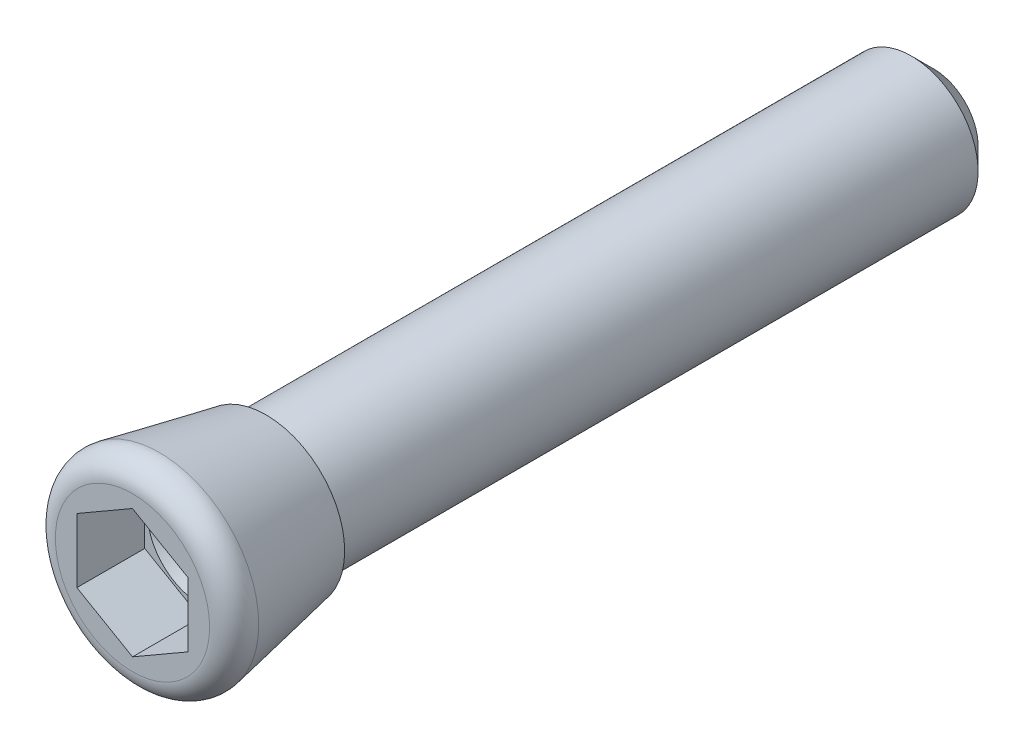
ISO-10303-21;
HEADER;
FILE_DESCRIPTION(('STEP AP214'),'2;1');
FILE_NAME('part.step','',(''),(''),'','','');
FILE_SCHEMA(('AUTOMOTIVE_DESIGN { 1 0 10303 214 1 1 1 1 }'));
ENDSEC;
DATA;
#1=APPLICATION_CONTEXT('core data for automotive mechanical design processes');
#2=APPLICATION_PROTOCOL_DEFINITION('international standard','automotive_design',2000,#1);
#3=PRODUCT_CONTEXT('',#1,'mechanical');
#4=PRODUCT('Part','Part','',(#3));
#5=PRODUCT_RELATED_PRODUCT_CATEGORY('part','',(#4));
#6=PRODUCT_DEFINITION_FORMATION('','',#4);
#7=PRODUCT_DEFINITION_CONTEXT('part definition',#1,'design');
#8=PRODUCT_DEFINITION('design','',#6,#7);
#9=PRODUCT_DEFINITION_SHAPE('','',#8);
#10=(LENGTH_UNIT() NAMED_UNIT(*) SI_UNIT(.MILLI.,.METRE.));
#11=(NAMED_UNIT(*) PLANE_ANGLE_UNIT() SI_UNIT($,.RADIAN.));
#12=(NAMED_UNIT(*) SI_UNIT($,.STERADIAN.) SOLID_ANGLE_UNIT());
#13=UNCERTAINTY_MEASURE_WITH_UNIT(LENGTH_MEASURE(1.E-05),#10,'distance_accuracy_value','');
#14=(GEOMETRIC_REPRESENTATION_CONTEXT(3) GLOBAL_UNCERTAINTY_ASSIGNED_CONTEXT((#13)) GLOBAL_UNIT_ASSIGNED_CONTEXT((#10,
#11,#12)) REPRESENTATION_CONTEXT('',''));
#15=CARTESIAN_POINT('',(0.,0.,0.));
#16=DIRECTION('',(0.,0.,1.));
#17=DIRECTION('',(1.,0.,0.));
#18=AXIS2_PLACEMENT_3D('',#15,#16,#17);
#19=CARTESIAN_POINT('',(0.,0.,-6.002));
#20=DIRECTION('',(0.,0.,-1.));
#21=DIRECTION('',(-1.,0.,0.));
#22=AXIS2_PLACEMENT_3D('',#19,#20,#21);
#23=CYLINDRICAL_SURFACE('',#22,3.);
#24=CARTESIAN_POINT('',(0.,0.,-35.002));
#25=DIRECTION('',(0.,0.,-1.));
#26=DIRECTION('',(-1.,0.,0.));
#27=AXIS2_PLACEMENT_3D('',#24,#25,#26);
#28=CIRCLE('',#27,3.);
#29=CARTESIAN_POINT('',(-3.,0.,-35.002));
#30=VERTEX_POINT('',#29);
#31=EDGE_CURVE('E22',#30,#30,#28,.F.);
#32=ORIENTED_EDGE('',*,*,#31,.T.);
#33=EDGE_LOOP('',(#32));
#34=FACE_BOUND('',#33,.T.);
#35=CARTESIAN_POINT('',(0.,0.,-6.002));
#36=DIRECTION('',(0.,0.,-1.));
#37=DIRECTION('',(-1.,0.,0.));
#38=AXIS2_PLACEMENT_3D('',#35,#36,#37);
#39=CIRCLE('',#38,3.);
#40=CARTESIAN_POINT('',(-3.,0.,-6.002));
#41=VERTEX_POINT('',#40);
#42=EDGE_CURVE('E124',#41,#41,#39,.T.);
#43=ORIENTED_EDGE('',*,*,#42,.T.);
#44=EDGE_LOOP('',(#43));
#45=FACE_BOUND('',#44,.T.);
#46=ADVANCED_FACE('F14',(#34,#45),#23,.T.);
#47=CARTESIAN_POINT('',(0.,0.,-1.20986193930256));
#48=DIRECTION('',(0.,0.,1.));
#49=DIRECTION('',(1.,0.,0.));
#50=AXIS2_PLACEMENT_3D('',#47,#48,#49);
#51=CONICAL_SURFACE('',#50,4.46382666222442,0.191986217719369);
#52=CARTESIAN_POINT('',(0.,0.,-1.20986193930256));
#53=DIRECTION('',(0.,0.,1.));
#54=DIRECTION('',(1.,0.,0.));
#55=AXIS2_PLACEMENT_3D('',#52,#53,#54);
#56=CIRCLE('',#55,4.46382666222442);
#57=CARTESIAN_POINT('',(4.46382666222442,0.,-1.20986193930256));
#58=VERTEX_POINT('',#57);
#59=EDGE_CURVE('E131',#58,#58,#56,.T.);
#60=ORIENTED_EDGE('',*,*,#59,.F.);
#61=EDGE_LOOP('',(#60));
#62=FACE_BOUND('',#61,.T.);
#63=CARTESIAN_POINT('',(0.,0.,-6.002));
#64=DIRECTION('',(0.,0.,-1.));
#65=DIRECTION('',(-1.,0.,0.));
#66=AXIS2_PLACEMENT_3D('',#63,#64,#65);
#67=CIRCLE('',#66,3.53232938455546);
#68=CARTESIAN_POINT('',(-3.53232938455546,0.,-6.002));
#69=VERTEX_POINT('',#68);
#70=EDGE_CURVE('E127',#69,#69,#67,.F.);
#71=ORIENTED_EDGE('',*,*,#70,.T.);
#72=EDGE_LOOP('',(#71));
#73=FACE_BOUND('',#72,.T.);
#74=ADVANCED_FACE('F157',(#62,#73),#51,.T.);
#75=CARTESIAN_POINT('',(0.,0.,0.));
#76=DIRECTION('',(0.,0.,1.));
#77=DIRECTION('',(1.,0.,0.));
#78=AXIS2_PLACEMENT_3D('',#75,#76,#77);
#79=PLANE('',#78);
#80=DIRECTION('',(0.866025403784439,-0.5,0.));
#81=VECTOR('',#80,1.);
#82=CARTESIAN_POINT('',(-2.5,-1.44337567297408,0.));
#83=LINE('',#82,#81);
#84=CARTESIAN_POINT('',(-2.5,-1.44337567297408,0.));
#85=VERTEX_POINT('',#84);
#86=CARTESIAN_POINT('',(0.,-2.88675134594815,0.));
#87=VERTEX_POINT('',#86);
#88=EDGE_CURVE('E29',#85,#87,#83,.T.);
#89=ORIENTED_EDGE('',*,*,#88,.F.);
#90=DIRECTION('',(0.,-1.,0.));
#91=VECTOR('',#90,1.);
#92=CARTESIAN_POINT('',(-2.5,1.44337567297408,0.));
#93=LINE('',#92,#91);
#94=CARTESIAN_POINT('',(-2.5,1.44337567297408,0.));
#95=VERTEX_POINT('',#94);
#96=EDGE_CURVE('E97',#95,#85,#93,.T.);
#97=ORIENTED_EDGE('',*,*,#96,.F.);
#98=DIRECTION('',(-0.866025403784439,-0.5,0.));
#99=VECTOR('',#98,1.);
#100=CARTESIAN_POINT('',(0.,2.88675134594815,0.));
#101=LINE('',#100,#99);
#102=CARTESIAN_POINT('',(0.,2.88675134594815,0.));
#103=VERTEX_POINT('',#102);
#104=EDGE_CURVE('E91',#103,#95,#101,.T.);
#105=ORIENTED_EDGE('',*,*,#104,.F.);
#106=DIRECTION('',(-0.866025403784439,0.5,0.));
#107=VECTOR('',#106,1.);
#108=CARTESIAN_POINT('',(2.5,1.44337567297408,0.));
#109=LINE('',#108,#107);
#110=CARTESIAN_POINT('',(2.5,1.44337567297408,0.));
#111=VERTEX_POINT('',#110);
#112=EDGE_CURVE('E89',#111,#103,#109,.T.);
#113=ORIENTED_EDGE('',*,*,#112,.F.);
#114=DIRECTION('',(0.,1.,0.));
#115=VECTOR('',#114,1.);
#116=CARTESIAN_POINT('',(2.5,-1.44337567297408,0.));
#117=LINE('',#116,#115);
#118=CARTESIAN_POINT('',(2.5,-1.44337567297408,0.));
#119=VERTEX_POINT('',#118);
#120=EDGE_CURVE('E71',#119,#111,#117,.T.);
#121=ORIENTED_EDGE('',*,*,#120,.F.);
#122=DIRECTION('',(0.866025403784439,0.5,0.));
#123=VECTOR('',#122,1.);
#124=CARTESIAN_POINT('',(0.,-2.88675134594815,0.));
#125=LINE('',#124,#123);
#126=EDGE_CURVE('E82',#87,#119,#125,.T.);
#127=ORIENTED_EDGE('',*,*,#126,.F.);
#128=EDGE_LOOP('',(#89,#97,#105,#113,#121,#127));
#129=FACE_BOUND('',#128,.T.);
#130=CARTESIAN_POINT('',(0.,0.,0.));
#131=DIRECTION('',(0.,0.,1.));
#132=DIRECTION('',(1.,0.,0.));
#133=AXIS2_PLACEMENT_3D('',#130,#131,#132);
#134=CIRCLE('',#133,3.46649344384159);
#135=CARTESIAN_POINT('',(3.46649344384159,0.,0.));
#136=VERTEX_POINT('',#135);
#137=EDGE_CURVE('E128',#136,#136,#134,.T.);
#138=ORIENTED_EDGE('',*,*,#137,.T.);
#139=EDGE_LOOP('',(#138));
#140=FACE_BOUND('',#139,.T.);
#141=ADVANCED_FACE('F16',(#129,#140),#79,.T.);
#142=CARTESIAN_POINT('',(0.,0.,-1.016));
#143=DIRECTION('',(0.,0.,1.));
#144=DIRECTION('',(1.,0.,0.));
#145=AXIS2_PLACEMENT_3D('',#142,#143,#144);
#146=TOROIDAL_SURFACE('',#145,3.46649344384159,1.016);
#147=ORIENTED_EDGE('',*,*,#59,.T.);
#148=EDGE_LOOP('',(#147));
#149=FACE_BOUND('',#148,.T.);
#150=ORIENTED_EDGE('',*,*,#137,.F.);
#151=EDGE_LOOP('',(#150));
#152=FACE_BOUND('',#151,.T.);
#153=ADVANCED_FACE('F173',(#149,#152),#146,.T.);
#154=CARTESIAN_POINT('',(0.,0.,-6.002));
#155=DIRECTION('',(0.,0.,-1.));
#156=DIRECTION('',(-1.,0.,0.));
#157=AXIS2_PLACEMENT_3D('',#154,#155,#156);
#158=PLANE('',#157);
#159=ORIENTED_EDGE('',*,*,#70,.F.);
#160=EDGE_LOOP('',(#159));
#161=FACE_BOUND('',#160,.T.);
#162=ORIENTED_EDGE('',*,*,#42,.F.);
#163=EDGE_LOOP('',(#162));
#164=FACE_BOUND('',#163,.T.);
#165=ADVANCED_FACE('F169',(#161,#164),#158,.T.);
#166=CARTESIAN_POINT('',(-5.,0.,-3.05));
#167=DIRECTION('',(0.,0.,-1.));
#168=DIRECTION('',(-1.,0.,0.));
#169=AXIS2_PLACEMENT_3D('',#166,#167,#168);
#170=PLANE('',#169);
#171=DIRECTION('',(0.866025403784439,-0.5,0.));
#172=VECTOR('',#171,1.);
#173=CARTESIAN_POINT('',(-2.5,-1.44337567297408,-3.05));
#174=LINE('',#173,#172);
#175=CARTESIAN_POINT('',(-2.5,-1.44337567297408,-3.05));
#176=VERTEX_POINT('',#175);
#177=CARTESIAN_POINT('',(0.,-2.88675134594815,-3.05));
#178=VERTEX_POINT('',#177);
#179=EDGE_CURVE('E100',#176,#178,#174,.T.);
#180=ORIENTED_EDGE('',*,*,#179,.T.);
#181=DIRECTION('',(0.866025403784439,0.5,0.));
#182=VECTOR('',#181,1.);
#183=CARTESIAN_POINT('',(0.,-2.88675134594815,-3.05));
#184=LINE('',#183,#182);
#185=CARTESIAN_POINT('',(2.5,-1.44337567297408,-3.05));
#186=VERTEX_POINT('',#185);
#187=EDGE_CURVE('E103',#178,#186,#184,.T.);
#188=ORIENTED_EDGE('',*,*,#187,.T.);
#189=DIRECTION('',(0.,1.,0.));
#190=VECTOR('',#189,1.);
#191=CARTESIAN_POINT('',(2.5,-1.44337567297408,-3.05));
#192=LINE('',#191,#190);
#193=CARTESIAN_POINT('',(2.5,1.44337567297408,-3.05));
#194=VERTEX_POINT('',#193);
#195=EDGE_CURVE('E74',#186,#194,#192,.T.);
#196=ORIENTED_EDGE('',*,*,#195,.T.);
#197=DIRECTION('',(-0.866025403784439,0.5,0.));
#198=VECTOR('',#197,1.);
#199=CARTESIAN_POINT('',(2.5,1.44337567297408,-3.05));
#200=LINE('',#199,#198);
#201=CARTESIAN_POINT('',(0.,2.88675134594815,-3.05));
#202=VERTEX_POINT('',#201);
#203=EDGE_CURVE('E106',#194,#202,#200,.T.);
#204=ORIENTED_EDGE('',*,*,#203,.T.);
#205=DIRECTION('',(-0.866025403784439,-0.5,0.));
#206=VECTOR('',#205,1.);
#207=CARTESIAN_POINT('',(0.,2.88675134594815,-3.05));
#208=LINE('',#207,#206);
#209=CARTESIAN_POINT('',(-2.5,1.44337567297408,-3.05));
#210=VERTEX_POINT('',#209);
#211=EDGE_CURVE('E109',#202,#210,#208,.T.);
#212=ORIENTED_EDGE('',*,*,#211,.T.);
#213=DIRECTION('',(0.,-1.,0.));
#214=VECTOR('',#213,1.);
#215=CARTESIAN_POINT('',(-2.5,1.44337567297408,-3.05));
#216=LINE('',#215,#214);
#217=EDGE_CURVE('E112',#210,#176,#216,.T.);
#218=ORIENTED_EDGE('',*,*,#217,.T.);
#219=EDGE_LOOP('',(#180,#188,#196,#204,#212,#218));
#220=FACE_BOUND('',#219,.T.);
#221=CARTESIAN_POINT('',(0.,0.,-3.05));
#222=DIRECTION('',(0.,0.,-1.));
#223=DIRECTION('',(-1.,0.,0.));
#224=AXIS2_PLACEMENT_3D('',#221,#222,#223);
#225=CIRCLE('',#224,2.37778589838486);
#226=CARTESIAN_POINT('',(-2.37778589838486,0.,-3.05));
#227=VERTEX_POINT('',#226);
#228=EDGE_CURVE('E117',#227,#227,#225,.F.);
#229=ORIENTED_EDGE('',*,*,#228,.F.);
#230=EDGE_LOOP('',(#229));
#231=FACE_BOUND('',#230,.T.);
#232=ADVANCED_FACE('F172',(#220,#231),#170,.F.);
#233=CARTESIAN_POINT('',(-2.5,-1.44337567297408,-3.05));
#234=DIRECTION('',(-0.5,-0.866025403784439,0.));
#235=DIRECTION('',(-0.866025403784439,0.5,0.));
#236=AXIS2_PLACEMENT_3D('',#233,#234,#235);
#237=PLANE('',#236);
#238=ORIENTED_EDGE('',*,*,#88,.T.);
#239=DIRECTION('',(0.,0.,1.));
#240=VECTOR('',#239,1.);
#241=CARTESIAN_POINT('',(0.,-2.88675134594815,-3.05));
#242=LINE('',#241,#240);
#243=EDGE_CURVE('E79',#178,#87,#242,.T.);
#244=ORIENTED_EDGE('',*,*,#243,.F.);
#245=ORIENTED_EDGE('',*,*,#179,.F.);
#246=DIRECTION('',(0.,0.,1.));
#247=VECTOR('',#246,1.);
#248=CARTESIAN_POINT('',(-2.5,-1.44337567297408,-3.05));
#249=LINE('',#248,#247);
#250=EDGE_CURVE('E115',#176,#85,#249,.T.);
#251=ORIENTED_EDGE('',*,*,#250,.T.);
#252=EDGE_LOOP('',(#238,#244,#245,#251));
#253=FACE_BOUND('',#252,.T.);
#254=ADVANCED_FACE('F167',(#253),#237,.F.);
#255=CARTESIAN_POINT('',(-2.5,1.44337567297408,-3.05));
#256=DIRECTION('',(-1.,0.,0.));
#257=DIRECTION('',(0.,0.,1.));
#258=AXIS2_PLACEMENT_3D('',#255,#256,#257);
#259=PLANE('',#258);
#260=ORIENTED_EDGE('',*,*,#96,.T.);
#261=ORIENTED_EDGE('',*,*,#250,.F.);
#262=ORIENTED_EDGE('',*,*,#217,.F.);
#263=DIRECTION('',(0.,0.,1.));
#264=VECTOR('',#263,1.);
#265=CARTESIAN_POINT('',(-2.5,1.44337567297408,-3.05));
#266=LINE('',#265,#264);
#267=EDGE_CURVE('E118',#210,#95,#266,.T.);
#268=ORIENTED_EDGE('',*,*,#267,.T.);
#269=EDGE_LOOP('',(#260,#261,#262,#268));
#270=FACE_BOUND('',#269,.T.);
#271=ADVANCED_FACE('F192',(#270),#259,.F.);
#272=CARTESIAN_POINT('',(0.,2.88675134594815,-3.05));
#273=DIRECTION('',(-0.5,0.866025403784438,0.));
#274=DIRECTION('',(0.866025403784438,0.5,0.));
#275=AXIS2_PLACEMENT_3D('',#272,#273,#274);
#276=PLANE('',#275);
#277=ORIENTED_EDGE('',*,*,#104,.T.);
#278=ORIENTED_EDGE('',*,*,#267,.F.);
#279=ORIENTED_EDGE('',*,*,#211,.F.);
#280=DIRECTION('',(0.,0.,1.));
#281=VECTOR('',#280,1.);
#282=CARTESIAN_POINT('',(0.,2.88675134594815,-3.05));
#283=LINE('',#282,#281);
#284=EDGE_CURVE('E120',#202,#103,#283,.T.);
#285=ORIENTED_EDGE('',*,*,#284,.T.);
#286=EDGE_LOOP('',(#277,#278,#279,#285));
#287=FACE_BOUND('',#286,.T.);
#288=ADVANCED_FACE('F196',(#287),#276,.F.);
#289=CARTESIAN_POINT('',(2.5,1.44337567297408,-3.05));
#290=DIRECTION('',(0.5,0.866025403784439,0.));
#291=DIRECTION('',(0.866025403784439,-0.5,0.));
#292=AXIS2_PLACEMENT_3D('',#289,#290,#291);
#293=PLANE('',#292);
#294=ORIENTED_EDGE('',*,*,#112,.T.);
#295=ORIENTED_EDGE('',*,*,#284,.F.);
#296=ORIENTED_EDGE('',*,*,#203,.F.);
#297=DIRECTION('',(0.,0.,1.));
#298=VECTOR('',#297,1.);
#299=CARTESIAN_POINT('',(2.5,1.44337567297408,-3.05));
#300=LINE('',#299,#298);
#301=EDGE_CURVE('E78',#194,#111,#300,.T.);
#302=ORIENTED_EDGE('',*,*,#301,.T.);
#303=EDGE_LOOP('',(#294,#295,#296,#302));
#304=FACE_BOUND('',#303,.T.);
#305=ADVANCED_FACE('F200',(#304),#293,.F.);
#306=CARTESIAN_POINT('',(2.5,-1.44337567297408,-3.05));
#307=DIRECTION('',(1.,0.,0.));
#308=DIRECTION('',(0.,-1.,0.));
#309=AXIS2_PLACEMENT_3D('',#306,#307,#308);
#310=PLANE('',#309);
#311=ORIENTED_EDGE('',*,*,#120,.T.);
#312=ORIENTED_EDGE('',*,*,#301,.F.);
#313=ORIENTED_EDGE('',*,*,#195,.F.);
#314=DIRECTION('',(0.,0.,1.));
#315=VECTOR('',#314,1.);
#316=CARTESIAN_POINT('',(2.5,-1.44337567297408,-3.05));
#317=LINE('',#316,#315);
#318=EDGE_CURVE('E67',#186,#119,#317,.T.);
#319=ORIENTED_EDGE('',*,*,#318,.T.);
#320=EDGE_LOOP('',(#311,#312,#313,#319));
#321=FACE_BOUND('',#320,.T.);
#322=ADVANCED_FACE('F69',(#321),#310,.F.);
#323=CARTESIAN_POINT('',(0.,-2.88675134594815,-3.05));
#324=DIRECTION('',(0.5,-0.866025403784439,0.));
#325=DIRECTION('',(-0.866025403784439,-0.5,0.));
#326=AXIS2_PLACEMENT_3D('',#323,#324,#325);
#327=PLANE('',#326);
#328=ORIENTED_EDGE('',*,*,#126,.T.);
#329=ORIENTED_EDGE('',*,*,#318,.F.);
#330=ORIENTED_EDGE('',*,*,#187,.F.);
#331=ORIENTED_EDGE('',*,*,#243,.T.);
#332=EDGE_LOOP('',(#328,#329,#330,#331));
#333=FACE_BOUND('',#332,.T.);
#334=ADVANCED_FACE('F83',(#333),#327,.F.);
#335=CARTESIAN_POINT('',(0.,0.,-3.048));
#336=DIRECTION('',(0.,0.,1.));
#337=DIRECTION('',(1.,0.,0.));
#338=AXIS2_PLACEMENT_3D('',#335,#336,#337);
#339=CONICAL_SURFACE('',#338,2.38125,1.0471975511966);
#340=ORIENTED_EDGE('',*,*,#228,.T.);
#341=EDGE_LOOP('',(#340));
#342=FACE_BOUND('',#341,.T.);
#343=CARTESIAN_POINT('',(0.,0.,-4.42281532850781));
#344=VERTEX_POINT('',#343);
#345=VERTEX_LOOP('',#344);
#346=FACE_BOUND('',#345,.T.);
#347=ADVANCED_FACE('F152',(#342,#346),#339,.F.);
#348=CARTESIAN_POINT('',(0.,0.,-36.002));
#349=DIRECTION('',(0.,0.,-1.));
#350=DIRECTION('',(-1.,0.,0.));
#351=AXIS2_PLACEMENT_3D('',#348,#349,#350);
#352=PLANE('',#351);
#353=CARTESIAN_POINT('',(0.,0.,-36.002));
#354=DIRECTION('',(0.,0.,-1.));
#355=DIRECTION('',(-1.,0.,0.));
#356=AXIS2_PLACEMENT_3D('',#353,#354,#355);
#357=CIRCLE('',#356,2.);
#358=CARTESIAN_POINT('',(-2.,0.,-36.002));
#359=VERTEX_POINT('',#358);
#360=EDGE_CURVE('E9',#359,#359,#357,.T.);
#361=ORIENTED_EDGE('',*,*,#360,.T.);
#362=EDGE_LOOP('',(#361));
#363=FACE_BOUND('',#362,.T.);
#364=ADVANCED_FACE('F144',(#363),#352,.T.);
#365=CARTESIAN_POINT('',(0.,0.,-35.002));
#366=DIRECTION('',(0.,0.,1.));
#367=DIRECTION('',(1.,0.,0.));
#368=AXIS2_PLACEMENT_3D('',#365,#366,#367);
#369=CONICAL_SURFACE('',#368,3.,0.785398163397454);
#370=ORIENTED_EDGE('',*,*,#360,.F.);
#371=EDGE_LOOP('',(#370));
#372=FACE_BOUND('',#371,.T.);
#373=ORIENTED_EDGE('',*,*,#31,.F.);
#374=EDGE_LOOP('',(#373));
#375=FACE_BOUND('',#374,.T.);
#376=ADVANCED_FACE('F142',(#372,#375),#369,.T.);
#377=CLOSED_SHELL('',(#46,#74,#141,#153,#165,#232,#254,#271,#288,#305,#322,#334,#347,#364,#376));
#378=MANIFOLD_SOLID_BREP('B1',#377);
#379=ADVANCED_BREP_SHAPE_REPRESENTATION('',(#18,#378),#14);
#380=SHAPE_DEFINITION_REPRESENTATION(#9,#379);
ENDSEC;
END-ISO-10303-21;
